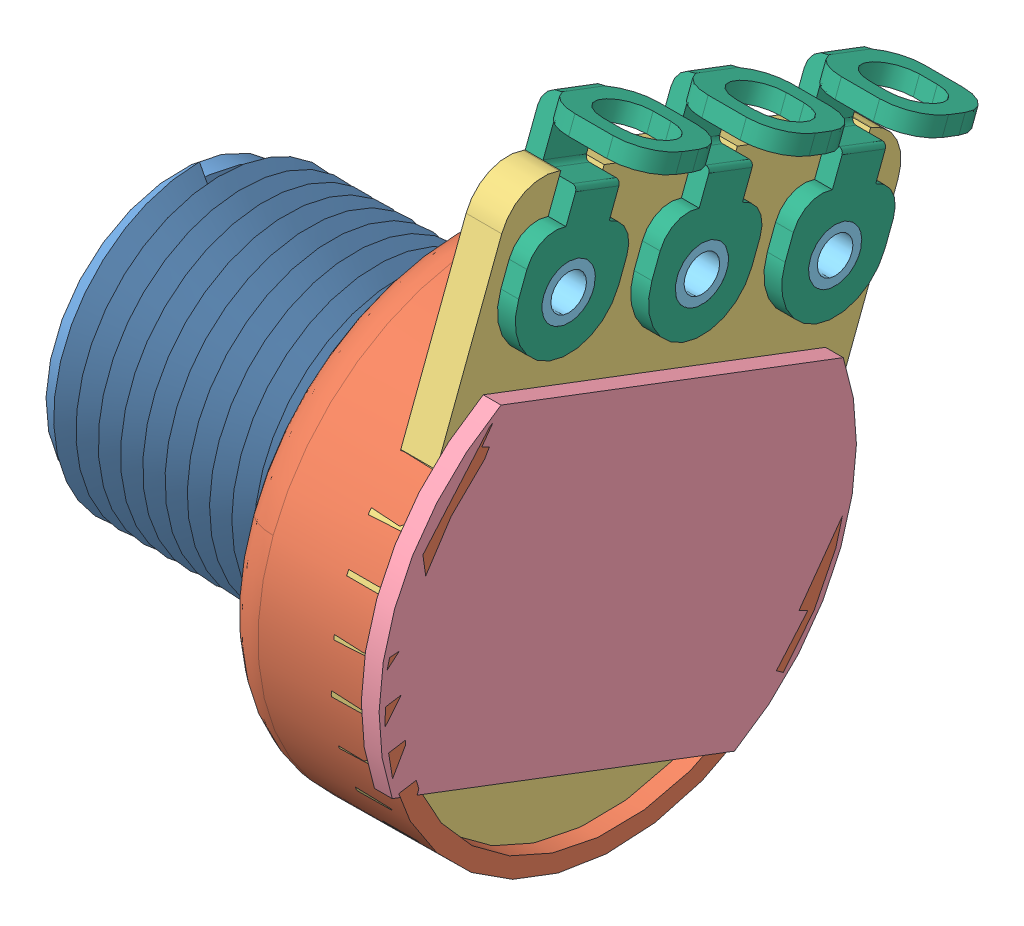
SolidWorks assembly Potar1.SLDASM, configuration Défaut (file format 7000). Lengths in mm.
Overall size (18.16 25.85 22.63).
10 component instances, 6 part files, 23 mates.
Components (placement in the parent):
- Potar12-1: Potar12.sldprt [Valor predeterminado<Como usinado>] at (6.6231 2.7832 48.1454) x (0 0.031189 0.999514) z (-1 0 0) size (10.47 10.47 9.77)
- Potar13-1: Potar13.sldprt [Valor predeterminado<Como usinado>] at (12.7191 2.7832 48.1454) x (0 0.355105 0.934827) z (-1 0 0) size (16.64 16.64 6.1)
- Potar14-1: Potar14.sldprt [Valor predeterminado<Como usinado>] at (12.0841 2.7832 48.1454) x (0 0.355105 0.934827) z (-1 0 0) size (16.64 19.94 1.27)
- Potar15-1: Potar15.sldprt [Valor predeterminado<Como usinado>] at (12.7191 2.7832 48.1454) x (0 0.355105 0.934827) z (-1 0 0) size (17.02 10.92 0.64)
- Potar16-1: Potar16.sldprt [Valor predeterminado<Como usinado>] at (12.7191 8.8744 40.3974) x (0 0 1) z (-1 0 0) size (2.54 2.54 2.22)
- Potar18-1: Potar18.sldprt [Valor predeterminado<Como usinado>] at (12.0841 8.221 44.042) x (0 0.934827 -0.355105) z (1 0 0) size (6.98 3.81 4.44)
- Potar18-2: Potar18.sldprt [Valor predeterminado<Como usinado>] at (12.0841 6.417 39.2931) x (0 0.934827 -0.355105) z (1 0 0) size (6.98 3.81 4.44)
- Potar18-3: Potar18.sldprt [Valor predeterminado<Como usinado>] at (12.0841 10.0249 48.7909) x (0 0.934827 -0.355105) z (1 0 0) size (6.98 3.81 4.44)
- Potar16-2: Potar16.sldprt [Valor predeterminado<Como usinado>] at (12.7191 10.6783 45.1464) x (0 0 1) z (-1 0 0) size (2.54 2.54 2.22)
- Potar16-3: Potar16.sldprt [Valor predeterminado<Como usinado>] at (12.7191 12.4822 49.8953) x (0 0 1) z (-1 0 0) size (2.54 2.54 2.22)
Mates (geometry in assembly coordinates):
- Coïncidente2: coincident anti-aligned: plane of Potar12-1 through (6.6231 -1.7009 43.7446) normal (1 0 0); plane of Potar13-1 through (6.6231 -6.0035 44.1965) normal (-1 0 0)
- Coïncidente3: coincident anti-aligned: plane of Potar13-1 through (10.8141 5.5246 40.2299) normal (1 0 0); plane of Potar14-1 through (10.8141 -8.0944 43.2722) normal (-1 0 0)
- Coaxiale3: concentric aligned: cylinder of Potar13-1 through (8.2106 2.7832 48.1454) axis (1 0 0) radius 7.6835; cylinder of Potar14-1 through (10.8141 2.7832 48.1454) axis (1 0 0) radius 8.3185
- Coaxiale4: concentric aligned: cylinder of Potar13-1 through (8.2106 2.7832 48.1454) axis (1 0 0) radius 7.6835; cylinder of Potar15-1 through (12.0841 2.7832 48.1454) axis (1 0 0) radius 8.509
- Parallèle1: parallel aligned: plane of Potar13-1 through (10.8141 9.7568 51.3712) normal (0 0.934827 -0.355105); plane of Potar15-1 through (12.0841 5.5711 40.1061) normal (0 0.934827 -0.355105)
- Coïncidente5: coincident anti-aligned: plane of Potar14-1 through (12.0841 -8.0944 43.2722) normal (1 0 0); plane of Potar15-1 through (12.0841 -5.3797 42.0347) normal (-1 0 0)
- Coaxiale5: concentric aligned: cylinder of Potar14-1 through (10.8141 12.4822 49.8953) axis (1 0 0) radius 0.9525; cylinder of Potar18-3 through (12.0841 12.4822 49.8953) axis (1 0 0) radius 0.9525
- Parallèle2: parallel aligned: plane of Potar14-1 through (10.8141 14.4211 48.2757) normal (0 0.934827 -0.355105); plane of Potar15-1 through (12.0841 5.5711 40.1061) normal (0 0.934827 -0.355105)
- Parallèle3: parallel anti-aligned: plane of Potar14-1 through (10.8141 14.4211 48.2757) normal (0 0.934827 -0.355105); plane of Potar18-3 through (11.9253 14.4277 48.2732) normal (0 -0.934827 0.355105)
- Coïncidente10: coincident anti-aligned: plane of Potar14-1 through (12.0841 -8.0944 43.2722) normal (1 0 0); plane of Potar18-3 through (12.0841 13.896 47.3204) normal (-1 0 0)
- Coaxiale6: concentric aligned: cylinder of Potar14-1 through (10.8141 10.6783 45.1464) axis (1 0 0) radius 0.9525; cylinder of Potar18-1 through (12.0841 10.6783 45.1464) axis (1 0 0) radius 0.9525
- Parallèle4: parallel anti-aligned: plane of Potar14-1 through (10.8141 12.6171 43.5268) normal (0 0.934827 -0.355105); plane of Potar18-1 through (11.9253 12.6238 43.5243) normal (0 -0.934827 0.355105)
- Coïncidente12: coincident anti-aligned: plane of Potar14-1 through (12.0841 -8.0944 43.2722) normal (1 0 0); plane of Potar18-1 through (12.0841 12.0921 42.5715) normal (-1 0 0)
- Coaxiale7: concentric aligned: cylinder of Potar14-1 through (10.8141 8.8744 40.3974) axis (1 0 0) radius 0.9525; cylinder of Potar18-2 through (12.0841 8.8744 40.3974) axis (1 0 0) radius 0.9525
- Parallèle5: parallel anti-aligned: plane of Potar14-1 through (10.8141 10.8132 38.7779) normal (0 0.934827 -0.355105); plane of Potar18-2 through (11.9253 10.8199 38.7754) normal (0 -0.934827 0.355105)
- Coïncidente14: coincident anti-aligned: plane of Potar14-1 through (12.0841 -8.0944 43.2722) normal (1 0 0); plane of Potar18-2 through (12.0841 10.2881 37.8226) normal (-1 0 0)
- Coaxiale9: concentric aligned: cylinder of Potar14-1 through (10.8141 12.4822 49.8953) axis (1 0 0) radius 0.9525; cylinder of Potar16-3 through (10.8141 12.4822 49.8953) axis (1 0 0) radius 0.9525
- Coaxiale10: concentric aligned: cylinder of Potar14-1 through (10.8141 10.6783 45.1464) axis (1 0 0) radius 0.9525; cylinder of Potar16-2 through (10.8141 10.6783 45.1464) axis (1 0 0) radius 0.9525
- Coaxiale11: concentric aligned: cylinder of Potar14-1 through (10.8141 8.8744 40.3974) axis (1 0 0) radius 0.9525; cylinder of Potar16-1 through (10.8141 8.8744 40.3974) axis (1 0 0) radius 0.9525
- Coïncidente15: coincident anti-aligned: plane of Potar14-1 through (10.8141 -8.0944 43.2722) normal (-1 0 0); plane of Potar16-1 through (10.8141 7.7498 39.3119) normal (1 0 0)
- Coïncidente16: coincident anti-aligned: plane of Potar14-1 through (10.8141 -8.0944 43.2722) normal (-1 0 0); plane of Potar16-2 through (10.8141 9.5537 44.0609) normal (1 0 0)
- Coïncidente17: coincident anti-aligned: plane of Potar14-1 through (10.8141 -8.0944 43.2722) normal (-1 0 0); plane of Potar16-3 through (10.8141 11.3576 48.8098) normal (1 0 0)
- Coaxiale12: concentric aligned: cylinder of Potar12-1 through (-2.9019 2.7832 48.1454) axis (1 0 0) radius 3.175; cylinder of Potar13-1 through (8.2106 2.7832 48.1454) axis (1 0 0) radius 8.3185
